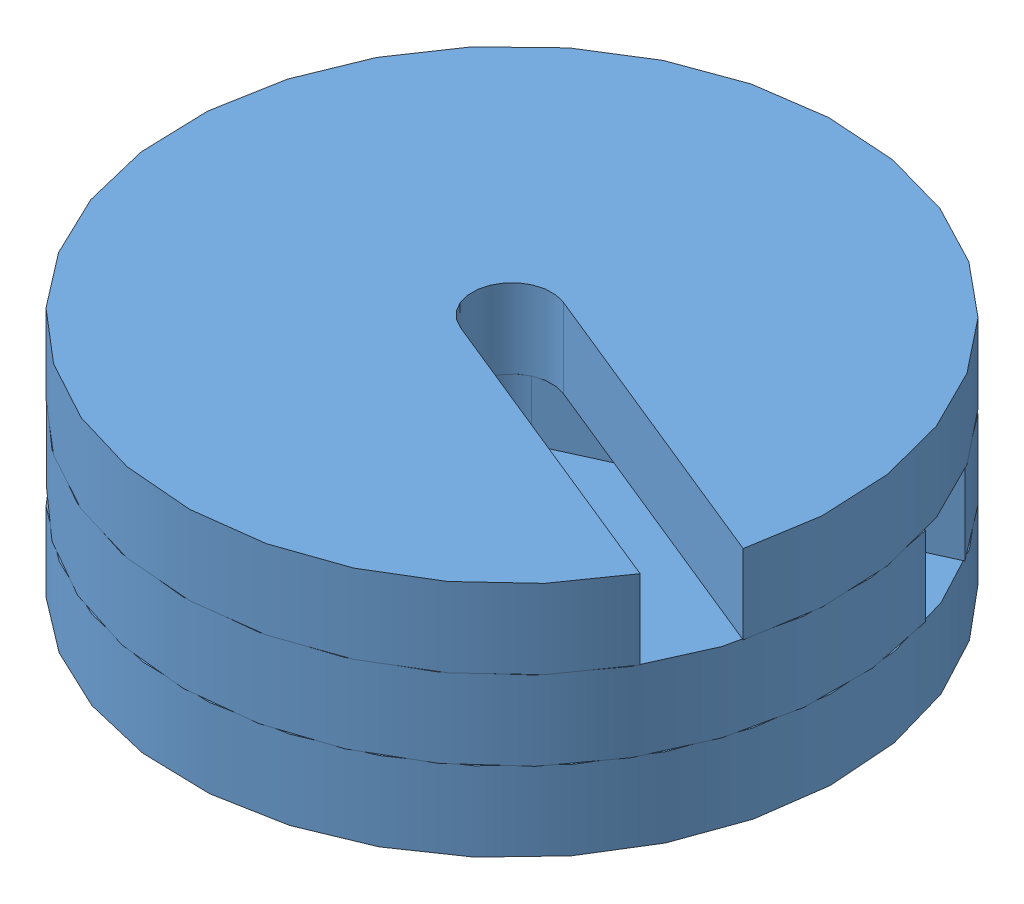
SolidWorks assembly Masses.SLDASM, configuration Défaut (file format 7000). Lengths in mm.
Overall size (132.98 36 132.81).
3 component instances, 1 part files, 3 mates.
Components (placement in the parent):
- Poids-1: Poids.SLDPRT [Défaut] at (121.5 147.5 -28) x (0.926228 0 0.376964) z (-0.376964 0 0.926228) size (99.64 12 100)
- Poids-2: Poids.SLDPRT [Défaut] at (121.5 123.5 -28) x (0.427137 0 -0.904187) z (0.904187 0 0.427137) size (99.64 12 100)
- Poids-3: Poids.SLDPRT [Défaut] at (121.5 135.5 -28) x (0.910084 0 -0.414424) z (0.414424 0 0.910084) size (99.64 12 100)
Mates (geometry in assembly coordinates):
- Coaxial4: concentric aligned: cylinder of Poids-1 through (121.5 135.5 -28) axis (0 1 0) radius 50; cylinder of Poids-2 through (121.5 111.5 -28) axis (0 1 0) radius 50
- Coïncidente4: coincident anti-aligned: plane of Poids-2 through (5.0997 123.5 20.5067) normal (0 1 0); plane of Poids-3 through (71.3668 123.5 87.7091) normal (0 -1 0)
- Coïncidente5: coincident anti-aligned: plane of Poids-1 through (2.9612 135.5 15.0172) normal (0 -1 0); plane of Poids-3 through (1.3055 135.5 -66.1472) normal (0 1 0)
